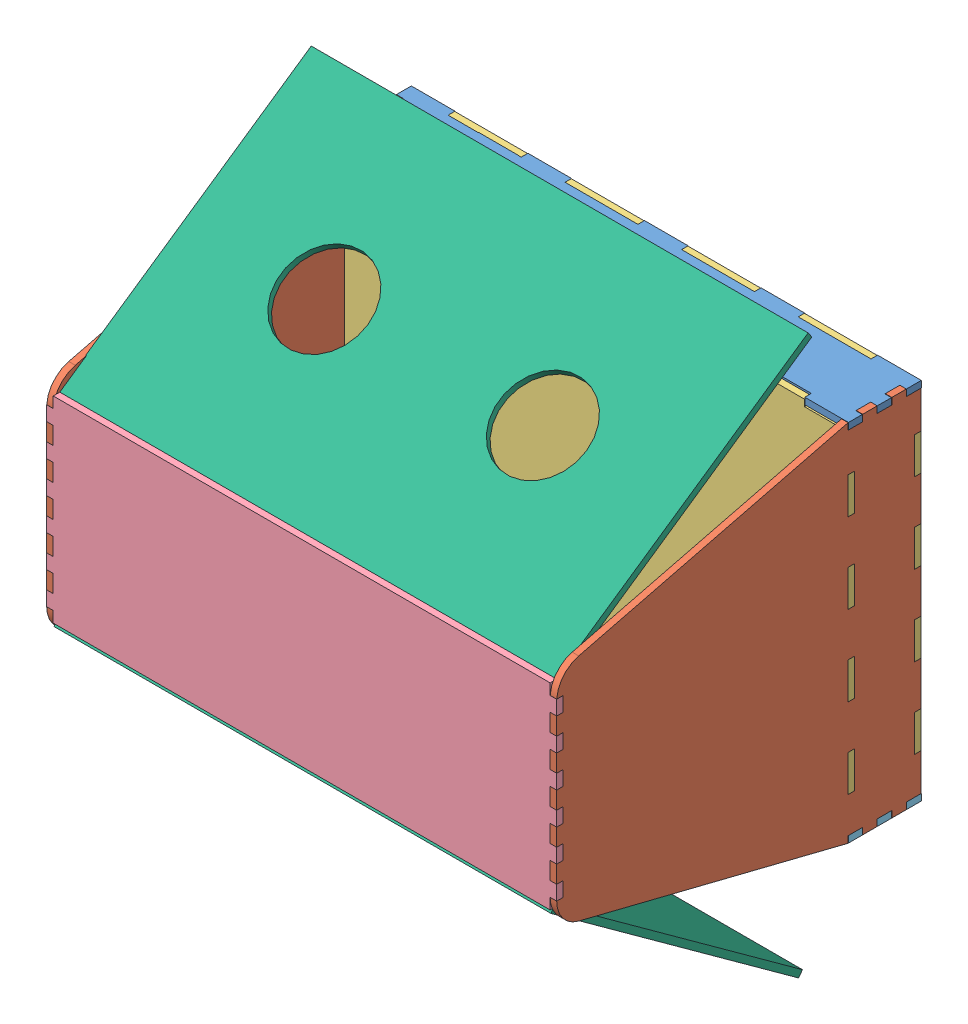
SolidWorks assembly baby incubator.SLDASM, configuration Default (file format 11000). Lengths in mm.
Overall size (700 761.93 500.5).
9 component instances, 6 part files, 17 mates.
Components (placement in the parent):
- botton side panel with holes-1: botton side panel with holes.SLDPRT [Default] at (465.7902 347.4754 438.45) size (700 9 100)
- side pannel-1: side pannel.SLDPRT [Default] at (115.7902 106.4754 745.3877) x (1 0 0) z (0 -1 0) size (9 500 500)
- side pannel-2: side pannel.SLDPRT [Default] at (806.7902 106.4754 745.3877) x (1 0 0) z (0 -1 0) size (9 500 500)
- bottom cover-1: bottom cover.SLDPRT [Default] at (465.7902 106.4754 397.95) x (0 1 0) z (-1 0 0) size (500 9 700)
- bottom cover-2: bottom cover.SLDPRT [Default] at (465.7902 104.4754 488.95) x (0 1 0) z (-1 0 0) size (500 9 700)
- top cover-1: top cover.SLDPRT [Default] at (465.7902 107.7065 879.95) x (1 0 0) z (0 -1 0) size (700 9 270)
- botton side panel1-1: botton side panel1.SLDPRT [Default] at (465.7902 -143.5246 438.45) size (700 9 100)
- acrylics side panel-1: acrylics side panel.SLDPRT [Default] at (464.833 354.2739 701.8104) x (0 0.824001 0.566588) z (-1 0 0) size (9 420 682)
- acrylics side panel-2: acrylics side panel.SLDPRT [Default] at (463.2123 -150.635 709.9886) x (0 -0.80934 0.58734) z (-1 0 0) size (9 420 682)
Mates (geometry in assembly coordinates):
- Coincident8: coincident: point of botton side panel with holes-1; point of side pannel-2
- Parallel4: parallel: plane of botton side panel with holes-1 through (115.7902 356.4754 388.45) normal (0 0 -1); plane of bottom cover-1 through (465.7902 106.4754 388.95) normal (0 0 -1)
- Coincident32: coincident: line of side pannel-2 through (815.7902 7.7065 879.95) axis (0 -1 0); line of top cover-1 through (815.7902 7.7065 879.95) axis (0 -1 0)
- Coincident33: coincident: point of side pannel-2; point of top cover-1
- Coincident36: coincident: plane of bottom cover-1 through (435.7902 -143.5246 498.3542) normal (0 -1 0); plane of botton side panel1-1 through (465.7902 -143.5246 438.45) normal (0 -1 0)
- Coincident38: coincident: point of side pannel-2; point of botton side panel1-1
- Coincident42: coincident: point of side pannel-1; point of botton side panel1-1
- Coincident44: coincident: plane of side pannel-1 through (115.7902 225.2444 848.95) normal (-1 0 0); plane of botton side panel1-1 through (115.7902 -134.5246 388.45) normal (-1 0 0)
- Coincident45: coincident: point of side pannel-1; point of bottom cover-1
- Coincident46: coincident: plane of side pannel-1 through (115.7902 225.2444 848.95) normal (-1 0 0); plane of bottom cover-1 through (115.7902 -83.5246 448.7535) normal (-1 0 0)
- Coincident47: coincident: point of botton side panel with holes-1; point of side pannel-1
- Coincident48: coincident: point of side pannel-1; point of top cover-1
- Coincident49: coincident: point of side pannel-1; point of bottom cover-2
- Coincident50: coincident: point of side pannel-2; point of bottom cover-2
- Parallel10: parallel: plane of botton side panel with holes-1 through (465.7902 356.4754 438.45) normal (0 1 0); plane of bottom cover-2 through (595.7902 354.4754 589.3542) normal (0 1 0)
- Coincident54: coincident: line of top cover-1 through (806.7902 242.7065 879.95) axis (-1 0 0); line of acrylics side panel-1 through (123.833 242.7065 879.95) axis (1 0 0)
- Coincident55: coincident: line of top cover-1 through (124.7902 -27.2935 879.95) axis (1 0 0); line of acrylics side panel-2 through (804.2123 -27.2935 879.95) axis (-1 0 0)
